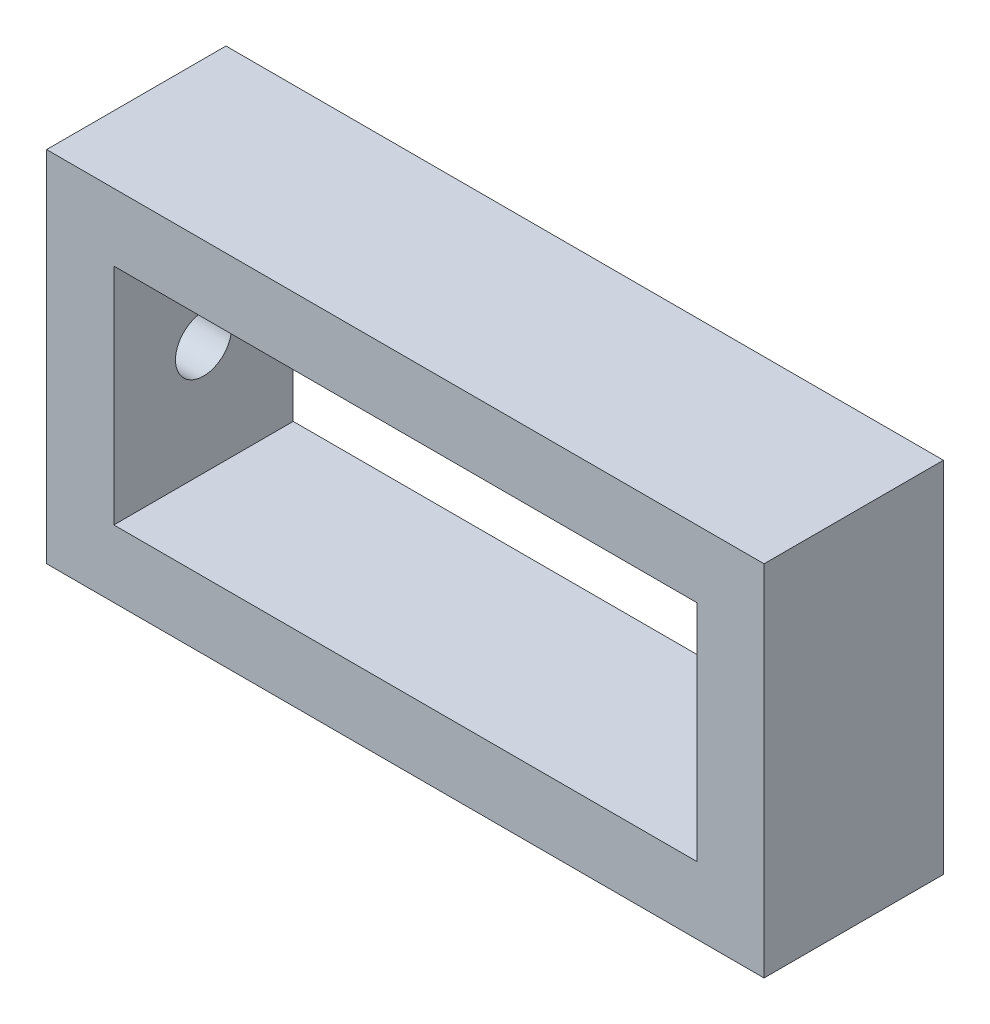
from build123d import *

# Parameters (mm, degrees)
SKETCH1_W           = 203.2
SKETCH1_H           = 101.6
SKETCH1_W_2         = 165.1
SKETCH1_H_2         = 63.5
BOSS_EXTRUDE1_DEPTH = 50.8
SKETCH2_R           = 7.9375
CUT_EXTRUDE1_DEPTH  = 50.8


with BuildPart() as part:
    # Sketch1 → Boss-Extrude1 (new body)
    with BuildSketch(Plane.XY):
        with Locations((101.6, 50.8)):
            Rectangle(SKETCH1_W, SKETCH1_H)
        with Locations((101.6, 50.8)):
            Rectangle(SKETCH1_W_2, SKETCH1_H_2, mode=Mode.SUBTRACT)
    extrude(amount=BOSS_EXTRUDE1_DEPTH)

    # Sketch2 → Cut-Extrude1 (cut)
    with BuildSketch(Plane.ZY):
        with Locations((25.4, 50.8)):
            Circle(SKETCH2_R)
    extrude(amount=-CUT_EXTRUDE1_DEPTH, mode=Mode.SUBTRACT)


solid = part.part
